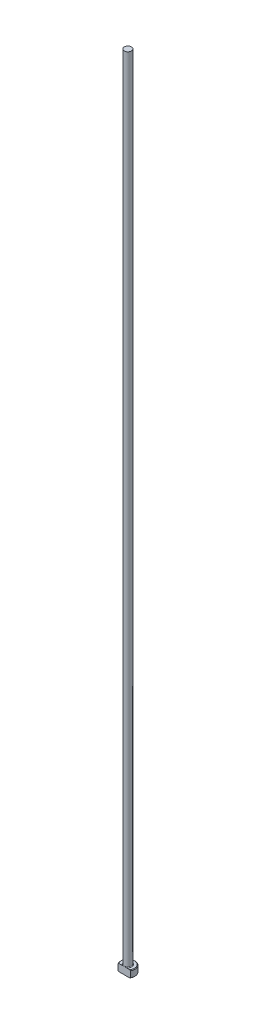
ISO-10303-21;
HEADER;
FILE_DESCRIPTION(('STEP AP214'),'2;1');
FILE_NAME('part.step','',(''),(''),'','','');
FILE_SCHEMA(('AUTOMOTIVE_DESIGN { 1 0 10303 214 1 1 1 1 }'));
ENDSEC;
DATA;
#1=APPLICATION_CONTEXT('core data for automotive mechanical design processes');
#2=APPLICATION_PROTOCOL_DEFINITION('international standard','automotive_design',2000,#1);
#3=PRODUCT_CONTEXT('',#1,'mechanical');
#4=PRODUCT('Part','Part','',(#3));
#5=PRODUCT_RELATED_PRODUCT_CATEGORY('part','',(#4));
#6=PRODUCT_DEFINITION_FORMATION('','',#4);
#7=PRODUCT_DEFINITION_CONTEXT('part definition',#1,'design');
#8=PRODUCT_DEFINITION('design','',#6,#7);
#9=PRODUCT_DEFINITION_SHAPE('','',#8);
#10=(LENGTH_UNIT() NAMED_UNIT(*) SI_UNIT(.MILLI.,.METRE.));
#11=(NAMED_UNIT(*) PLANE_ANGLE_UNIT() SI_UNIT($,.RADIAN.));
#12=(NAMED_UNIT(*) SI_UNIT($,.STERADIAN.) SOLID_ANGLE_UNIT());
#13=UNCERTAINTY_MEASURE_WITH_UNIT(LENGTH_MEASURE(1.E-05),#10,'distance_accuracy_value','');
#14=(GEOMETRIC_REPRESENTATION_CONTEXT(3) GLOBAL_UNCERTAINTY_ASSIGNED_CONTEXT((#13)) GLOBAL_UNIT_ASSIGNED_CONTEXT((#10,
#11,#12)) REPRESENTATION_CONTEXT('',''));
#15=CARTESIAN_POINT('',(0.,0.,0.));
#16=DIRECTION('',(0.,0.,1.));
#17=DIRECTION('',(1.,0.,0.));
#18=AXIS2_PLACEMENT_3D('',#15,#16,#17);
#19=CARTESIAN_POINT('',(0.,0.,0.));
#20=DIRECTION('',(0.,-1.,0.));
#21=DIRECTION('',(0.,0.,-1.));
#22=AXIS2_PLACEMENT_3D('',#19,#20,#21);
#23=PLANE('',#22);
#24=CARTESIAN_POINT('',(0.,0.,0.));
#25=DIRECTION('',(0.,-1.,0.));
#26=DIRECTION('',(0.,0.,-1.));
#27=AXIS2_PLACEMENT_3D('',#24,#25,#26);
#28=CIRCLE('',#27,2.92099999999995);
#29=CARTESIAN_POINT('',(-2.45195529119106,0.,1.58749999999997));
#30=VERTEX_POINT('',#29);
#31=CARTESIAN_POINT('',(2.45195529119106,0.,1.58749999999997));
#32=VERTEX_POINT('',#31);
#33=EDGE_CURVE('E98',#30,#32,#28,.T.);
#34=ORIENTED_EDGE('',*,*,#33,.T.);
#35=DIRECTION('',(-1.,0.,0.));
#36=VECTOR('',#35,1.);
#37=CARTESIAN_POINT('',(-2.74963065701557,0.,1.58749999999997));
#38=LINE('',#37,#36);
#39=EDGE_CURVE('E83',#32,#30,#38,.T.);
#40=ORIENTED_EDGE('',*,*,#39,.T.);
#41=EDGE_LOOP('',(#34,#40));
#42=FACE_BOUND('',#41,.T.);
#43=ADVANCED_FACE('F32',(#42),#23,.T.);
#44=CARTESIAN_POINT('',(0.,259.958771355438,0.));
#45=DIRECTION('',(0.,1.,0.));
#46=DIRECTION('',(0.,0.,1.));
#47=AXIS2_PLACEMENT_3D('',#44,#45,#46);
#48=CYLINDRICAL_SURFACE('',#47,3.17499999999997);
#49=CARTESIAN_POINT('',(0.,2.92100000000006,0.));
#50=DIRECTION('',(0.,1.,0.));
#51=DIRECTION('',(0.,0.,1.));
#52=AXIS2_PLACEMENT_3D('',#49,#50,#51);
#53=CIRCLE('',#52,3.17499999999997);
#54=CARTESIAN_POINT('',(-2.74963065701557,2.92100000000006,1.58749999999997));
#55=VERTEX_POINT('',#54);
#56=CARTESIAN_POINT('',(2.74963065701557,2.92100000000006,1.58749999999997));
#57=VERTEX_POINT('',#56);
#58=EDGE_CURVE('E104',#55,#57,#53,.F.);
#59=ORIENTED_EDGE('',*,*,#58,.T.);
#60=DIRECTION('',(0.,-1.,0.));
#61=VECTOR('',#60,1.);
#62=CARTESIAN_POINT('',(2.74963065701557,355.6,1.58749999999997));
#63=LINE('',#62,#61);
#64=CARTESIAN_POINT('',(2.74963065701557,0.254000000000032,1.58749999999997));
#65=VERTEX_POINT('',#64);
#66=EDGE_CURVE('E183',#57,#65,#63,.T.);
#67=ORIENTED_EDGE('',*,*,#66,.T.);
#68=CARTESIAN_POINT('',(0.,0.254000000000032,0.));
#69=DIRECTION('',(0.,-1.,0.));
#70=DIRECTION('',(0.,0.,-1.));
#71=AXIS2_PLACEMENT_3D('',#68,#69,#70);
#72=CIRCLE('',#71,3.17499999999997);
#73=CARTESIAN_POINT('',(-2.74963065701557,0.254000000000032,1.58749999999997));
#74=VERTEX_POINT('',#73);
#75=EDGE_CURVE('E100',#65,#74,#72,.F.);
#76=ORIENTED_EDGE('',*,*,#75,.T.);
#77=DIRECTION('',(0.,-1.,0.));
#78=VECTOR('',#77,1.);
#79=CARTESIAN_POINT('',(-2.74963065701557,355.6,1.58749999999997));
#80=LINE('',#79,#78);
#81=EDGE_CURVE('E93',#55,#74,#80,.T.);
#82=ORIENTED_EDGE('',*,*,#81,.F.);
#83=EDGE_LOOP('',(#59,#67,#76,#82));
#84=FACE_BOUND('',#83,.T.);
#85=ADVANCED_FACE('F158',(#84),#48,.T.);
#86=CARTESIAN_POINT('',(-3.17499999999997,3.175,0.));
#87=DIRECTION('',(0.,1.,0.));
#88=DIRECTION('',(0.,0.,1.));
#89=AXIS2_PLACEMENT_3D('',#86,#87,#88);
#90=PLANE('',#89);
#91=CARTESIAN_POINT('',(0.,3.175,0.));
#92=DIRECTION('',(0.,1.,0.));
#93=DIRECTION('',(0.,0.,1.));
#94=AXIS2_PLACEMENT_3D('',#91,#92,#93);
#95=CIRCLE('',#94,2.92100000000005);
#96=CARTESIAN_POINT('',(2.45195529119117,3.175,1.58749999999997));
#97=VERTEX_POINT('',#96);
#98=CARTESIAN_POINT('',(-2.45195529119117,3.175,1.58749999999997));
#99=VERTEX_POINT('',#98);
#100=EDGE_CURVE('E178',#97,#99,#95,.T.);
#101=ORIENTED_EDGE('',*,*,#100,.T.);
#102=DIRECTION('',(1.,0.,0.));
#103=VECTOR('',#102,1.);
#104=CARTESIAN_POINT('',(-3.17499999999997,3.175,1.58749999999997));
#105=LINE('',#104,#103);
#106=CARTESIAN_POINT('',(-0.933255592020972,3.17500000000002,1.58749999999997));
#107=VERTEX_POINT('',#106);
#108=EDGE_CURVE('E57',#99,#107,#105,.T.);
#109=ORIENTED_EDGE('',*,*,#108,.T.);
#110=CARTESIAN_POINT('',(0.,3.175,0.));
#111=DIRECTION('',(0.,1.,0.));
#112=DIRECTION('',(0.,0.,1.));
#113=AXIS2_PLACEMENT_3D('',#110,#111,#112);
#114=CIRCLE('',#113,1.84149999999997);
#115=CARTESIAN_POINT('',(0.933255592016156,3.17500000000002,1.58749999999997));
#116=VERTEX_POINT('',#115);
#117=EDGE_CURVE('E107',#107,#116,#114,.F.);
#118=ORIENTED_EDGE('',*,*,#117,.T.);
#119=EDGE_CURVE('E136',#116,#97,#105,.T.);
#120=ORIENTED_EDGE('',*,*,#119,.T.);
#121=EDGE_LOOP('',(#101,#109,#118,#120));
#122=FACE_BOUND('',#121,.T.);
#123=ADVANCED_FACE('F147',(#122),#90,.T.);
#124=CARTESIAN_POINT('',(0.,3.17499999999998,0.));
#125=DIRECTION('',(0.,-1.,0.));
#126=DIRECTION('',(0.,0.,-1.));
#127=AXIS2_PLACEMENT_3D('',#124,#125,#126);
#128=CONICAL_SURFACE('',#127,2.92100000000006,0.785398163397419);
#129=ORIENTED_EDGE('',*,*,#58,.F.);
#130=CARTESIAN_POINT('',(-6.0529050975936,-0.161620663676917,1.58749999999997));
#131=CARTESIAN_POINT('',(-5.91567682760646,-0.0288893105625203,1.58749999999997));
#132=CARTESIAN_POINT('',(-5.77831035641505,0.1036996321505,1.58749999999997));
#133=CARTESIAN_POINT('',(-5.50321874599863,0.368508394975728,1.58749999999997));
#134=CARTESIAN_POINT('',(-5.36549360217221,0.500728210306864,1.58749999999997));
#135=CARTESIAN_POINT('',(-5.08953516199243,0.764778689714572,1.58749999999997));
#136=CARTESIAN_POINT('',(-4.95130164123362,0.89660911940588,1.58749999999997));
#137=CARTESIAN_POINT('',(-4.67428233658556,1.15968706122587,1.58749999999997));
#138=CARTESIAN_POINT('',(-4.5354965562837,1.2909345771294,1.58749999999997));
#139=CARTESIAN_POINT('',(-4.25997724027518,1.55007705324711,1.58749999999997));
#140=CARTESIAN_POINT('',(-4.12325766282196,1.67798684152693,1.58749999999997));
#141=CARTESIAN_POINT('',(-3.84892898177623,1.93284861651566,1.58749999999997));
#142=CARTESIAN_POINT('',(-3.71131988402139,2.05980060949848,1.58749999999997));
#143=CARTESIAN_POINT('',(-3.43493978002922,2.31237508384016,1.58749999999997));
#144=CARTESIAN_POINT('',(-3.29616903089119,2.43799784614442,1.58749999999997));
#145=CARTESIAN_POINT('',(-3.0169955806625,2.6874136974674,1.58749999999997));
#146=CARTESIAN_POINT('',(-2.87659294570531,2.81120686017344,1.58749999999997));
#147=CARTESIAN_POINT('',(-2.64816703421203,3.00875865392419,1.58749999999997));
#148=CARTESIAN_POINT('',(-2.56087478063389,3.08336151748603,1.58749999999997));
#149=CARTESIAN_POINT('',(-2.38515423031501,3.2312387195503,1.58749999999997));
#150=CARTESIAN_POINT('',(-2.2967258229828,3.30451292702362,1.58749999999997));
#151=CARTESIAN_POINT('',(-2.11747400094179,3.45004422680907,1.58749999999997));
#152=CARTESIAN_POINT('',(-2.02663514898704,3.522282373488,1.58749999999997));
#153=CARTESIAN_POINT('',(-1.84302524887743,3.66423097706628,1.58749999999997));
#154=CARTESIAN_POINT('',(-1.7502546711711,3.73394203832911,1.58749999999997));
#155=CARTESIAN_POINT('',(-1.56067475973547,3.87080633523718,1.58749999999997));
#156=CARTESIAN_POINT('',(-1.46382547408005,3.93790459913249,1.58749999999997));
#157=CARTESIAN_POINT('',(-1.26632594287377,4.06669147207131,1.58749999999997));
#158=CARTESIAN_POINT('',(-1.1656707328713,4.12837264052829,1.58749999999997));
#159=CARTESIAN_POINT('',(-1.01165766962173,4.21402252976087,1.58749999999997));
#160=CARTESIAN_POINT('',(-0.960142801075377,4.24127929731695,1.58749999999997));
#161=CARTESIAN_POINT('',(-0.855780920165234,4.29309798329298,1.58749999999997));
#162=CARTESIAN_POINT('',(-0.802933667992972,4.31765941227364,1.58749999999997));
#163=CARTESIAN_POINT('',(-0.64246114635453,4.38614656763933,1.58749999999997));
#164=CARTESIAN_POINT('',(-0.53251850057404,4.42510149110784,1.58749999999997));
#165=CARTESIAN_POINT('',(-0.367680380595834,4.46726244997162,1.58749999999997));
#166=CARTESIAN_POINT('',(-0.314802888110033,4.47844427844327,1.58749999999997));
#167=CARTESIAN_POINT('',(-0.208209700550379,4.49576654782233,1.58749999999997));
#168=CARTESIAN_POINT('',(-0.154494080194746,4.50190743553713,1.58749999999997));
#169=CARTESIAN_POINT('',(-0.0468792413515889,4.50871296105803,1.58749999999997));
#170=CARTESIAN_POINT('',(0.0070188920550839,4.5093945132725,1.58749999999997));
#171=CARTESIAN_POINT('',(0.114606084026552,4.50527679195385,1.58749999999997));
#172=CARTESIAN_POINT('',(0.168295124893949,4.50047706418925,1.58749999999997));
#173=CARTESIAN_POINT('',(0.274485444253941,4.48579689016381,1.58749999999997));
#174=CARTESIAN_POINT('',(0.326992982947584,4.47596081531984,1.58749999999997));
#175=CARTESIAN_POINT('',(0.430974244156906,4.45181809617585,1.58749999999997));
#176=CARTESIAN_POINT('',(0.482447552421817,4.4375096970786,1.58749999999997));
#177=CARTESIAN_POINT('',(0.58446088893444,4.40502489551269,1.58749999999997));
#178=CARTESIAN_POINT('',(0.634994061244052,4.38682724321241,1.58749999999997));
#179=CARTESIAN_POINT('',(0.734789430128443,4.34729308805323,1.58749999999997));
#180=CARTESIAN_POINT('',(0.784051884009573,4.32595722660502,1.58749999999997));
#181=CARTESIAN_POINT('',(0.930549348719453,4.25791922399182,1.58749999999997));
#182=CARTESIAN_POINT('',(1.02598802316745,4.20736047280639,1.58749999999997));
#183=CARTESIAN_POINT('',(1.21304313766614,4.09955451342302,1.58749999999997));
#184=CARTESIAN_POINT('',(1.30465471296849,4.042299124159,1.58749999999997));
#185=CARTESIAN_POINT('',(1.48526211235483,3.92308746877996,1.58749999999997));
#186=CARTESIAN_POINT('',(1.57424615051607,3.86111349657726,1.58749999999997));
#187=CARTESIAN_POINT('',(1.74990003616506,3.73408621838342,1.58749999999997));
#188=CARTESIAN_POINT('',(1.8365709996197,3.66903444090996,1.58749999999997));
#189=CARTESIAN_POINT('',(2.00931764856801,3.53583371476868,1.58749999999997));
#190=CARTESIAN_POINT('',(2.09537048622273,3.4676552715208,1.58749999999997));
#191=CARTESIAN_POINT('',(2.26611736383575,3.32960643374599,1.58749999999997));
#192=CARTESIAN_POINT('',(2.35081125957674,3.25973586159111,1.58749999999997));
#193=CARTESIAN_POINT('',(2.60290121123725,3.04858139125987,1.58749999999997));
#194=CARTESIAN_POINT('',(2.76872537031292,2.90542388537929,1.58749999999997));
#195=CARTESIAN_POINT('',(3.06970913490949,2.64069522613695,1.58749999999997));
#196=CARTESIAN_POINT('',(3.2052866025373,2.51959458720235,1.58749999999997));
#197=CARTESIAN_POINT('',(3.47510321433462,2.27590400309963,1.58749999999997));
#198=CARTESIAN_POINT('',(3.60934232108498,2.15331401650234,1.58749999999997));
#199=CARTESIAN_POINT('',(3.87695374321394,1.90694239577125,1.58749999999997));
#200=CARTESIAN_POINT('',(4.01032512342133,1.78315974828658,1.58749999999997));
#201=CARTESIAN_POINT('',(4.27630880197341,1.53478104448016,1.58749999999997));
#202=CARTESIAN_POINT('',(4.40892109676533,1.41018498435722,1.58749999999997));
#203=CARTESIAN_POINT('',(4.79499418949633,1.04574684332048,1.58749999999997));
#204=CARTESIAN_POINT('',(5.04767313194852,0.805076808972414,1.58749999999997));
#205=CARTESIAN_POINT('',(5.42550911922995,0.443121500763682,1.58749999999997));
#206=CARTESIAN_POINT('',(5.55118772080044,0.322378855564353,1.58749999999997));
#207=CARTESIAN_POINT('',(5.8022520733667,0.0805914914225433,1.58749999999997));
#208=CARTESIAN_POINT('',(5.92763782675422,-0.0404532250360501,1.58749999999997));
#209=CARTESIAN_POINT('',(6.0529050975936,-0.161620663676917,1.58749999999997));
#210=B_SPLINE_CURVE_WITH_KNOTS('',3,(#130,#131,#132,#133,#134,#135,#136,#137,#138,#139,#140,
#141,#142,#143,#144,#145,#146,#147,#148,#149,#150,#151,#152,#153,#154,#155,#156,#157,#158,#159,
#160,#161,#162,#163,#164,#165,#166,#167,#168,#169,#170,#171,#172,#173,#174,#175,#176,#177,#178,
#179,#180,#181,#182,#183,#184,#185,#186,#187,#188,#189,#190,#191,#192,#193,#194,#195,#196,#197,
#198,#199,#200,#201,#202,#203,#204,#205,#206,#207,#208,#209),.UNSPECIFIED.,.F.,.F.,(4,2,2,2,2,2,
2,2,2,2,2,2,2,2,2,2,2,2,2,2,2,2,2,2,2,2,2,2,2,2,2,2,2,2,2,2,2,2,2,4),(0.,0.572750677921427,
1.14550874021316,1.71856057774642,2.29160869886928,2.85328006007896,3.41494773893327,
3.97649423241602,4.5380180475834,4.88249307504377,5.22700189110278,5.57515326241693,
5.92322081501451,6.27657800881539,6.63041319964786,6.80518126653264,6.97998101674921,
7.32824262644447,7.49018491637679,7.65211285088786,7.81353889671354,7.97497832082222,
8.13501929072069,8.29512313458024,8.45612518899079,8.61709438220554,8.94062993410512,
9.26456495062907,9.58978187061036,9.91483894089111,10.2441741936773,10.5735441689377,
11.2306812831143,11.776033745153,12.3214014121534,12.8672825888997,13.4131663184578,
14.4600164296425,14.9828595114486,15.505698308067),.UNSPECIFIED.);
#211=EDGE_CURVE('E135',#55,#99,#210,.T.);
#212=ORIENTED_EDGE('',*,*,#211,.T.);
#213=ORIENTED_EDGE('',*,*,#100,.F.);
#214=EDGE_CURVE('E127',#97,#57,#210,.T.);
#215=ORIENTED_EDGE('',*,*,#214,.T.);
#216=EDGE_LOOP('',(#129,#212,#213,#215));
#217=FACE_BOUND('',#216,.T.);
#218=ADVANCED_FACE('F143',(#217),#128,.T.);
#219=CARTESIAN_POINT('',(0.,0.254000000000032,0.));
#220=DIRECTION('',(0.,1.,0.));
#221=DIRECTION('',(0.,0.,1.));
#222=AXIS2_PLACEMENT_3D('',#219,#220,#221);
#223=CONICAL_SURFACE('',#222,3.17499999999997,0.785398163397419);
#224=ORIENTED_EDGE('',*,*,#75,.F.);
#225=CARTESIAN_POINT('',(6.0529050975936,3.33662066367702,1.58749999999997));
#226=CARTESIAN_POINT('',(5.91567682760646,3.20388931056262,1.58749999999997));
#227=CARTESIAN_POINT('',(5.77831035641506,3.0713003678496,1.58749999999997));
#228=CARTESIAN_POINT('',(5.50321874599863,2.80649160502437,1.58749999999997));
#229=CARTESIAN_POINT('',(5.36549360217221,2.67427178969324,1.58749999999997));
#230=CARTESIAN_POINT('',(5.08953516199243,2.41022131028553,1.58749999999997));
#231=CARTESIAN_POINT('',(4.95130164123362,2.27839088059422,1.58749999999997));
#232=CARTESIAN_POINT('',(4.67428233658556,2.01531293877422,1.58749999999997));
#233=CARTESIAN_POINT('',(4.5354965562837,1.88406542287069,1.58749999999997));
#234=CARTESIAN_POINT('',(4.25997724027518,1.62492294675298,1.58749999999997));
#235=CARTESIAN_POINT('',(4.12325766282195,1.49701315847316,1.58749999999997));
#236=CARTESIAN_POINT('',(3.84892898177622,1.24215138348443,1.58749999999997));
#237=CARTESIAN_POINT('',(3.71131988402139,1.11519939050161,1.58749999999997));
#238=CARTESIAN_POINT('',(3.43493978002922,0.862624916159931,1.58749999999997));
#239=CARTESIAN_POINT('',(3.29616903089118,0.737002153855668,1.58749999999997));
#240=CARTESIAN_POINT('',(3.01699558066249,0.487586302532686,1.58749999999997));
#241=CARTESIAN_POINT('',(2.8765929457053,0.363793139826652,1.58749999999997));
#242=CARTESIAN_POINT('',(2.64816703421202,0.166241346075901,1.58749999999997));
#243=CARTESIAN_POINT('',(2.56087478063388,0.0916384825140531,1.58749999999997));
#244=CARTESIAN_POINT('',(2.385154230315,-0.056238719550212,1.58749999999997));
#245=CARTESIAN_POINT('',(2.29672582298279,-0.129512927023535,1.58749999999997));
#246=CARTESIAN_POINT('',(2.11747400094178,-0.275044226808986,1.58749999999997));
#247=CARTESIAN_POINT('',(2.02663514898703,-0.347282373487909,1.58749999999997));
#248=CARTESIAN_POINT('',(1.84302524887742,-0.489230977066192,1.58749999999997));
#249=CARTESIAN_POINT('',(1.75025467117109,-0.558942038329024,1.58749999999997));
#250=CARTESIAN_POINT('',(1.56067475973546,-0.695806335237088,1.58749999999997));
#251=CARTESIAN_POINT('',(1.46382547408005,-0.7629045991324,1.58749999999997));
#252=CARTESIAN_POINT('',(1.26632594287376,-0.891691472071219,1.58749999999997));
#253=CARTESIAN_POINT('',(1.16567073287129,-0.953372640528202,1.58749999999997));
#254=CARTESIAN_POINT('',(1.01165766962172,-1.03902252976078,1.58749999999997));
#255=CARTESIAN_POINT('',(0.96014280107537,-1.06627929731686,1.58749999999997));
#256=CARTESIAN_POINT('',(0.855780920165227,-1.11809798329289,1.58749999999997));
#257=CARTESIAN_POINT('',(0.802933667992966,-1.14265941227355,1.58749999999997));
#258=CARTESIAN_POINT('',(0.642461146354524,-1.21114656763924,1.58749999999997));
#259=CARTESIAN_POINT('',(0.532518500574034,-1.25010149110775,1.58749999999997));
#260=CARTESIAN_POINT('',(0.367680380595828,-1.29226244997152,1.58749999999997));
#261=CARTESIAN_POINT('',(0.314802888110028,-1.30344427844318,1.58749999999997));
#262=CARTESIAN_POINT('',(0.208209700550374,-1.32076654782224,1.58749999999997));
#263=CARTESIAN_POINT('',(0.154494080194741,-1.32690743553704,1.58749999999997));
#264=CARTESIAN_POINT('',(0.046879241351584,-1.33371296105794,1.58749999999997));
#265=CARTESIAN_POINT('',(-0.00701889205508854,-1.3343945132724,1.58749999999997));
#266=CARTESIAN_POINT('',(-0.114606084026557,-1.33027679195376,1.58749999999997));
#267=CARTESIAN_POINT('',(-0.168295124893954,-1.32547706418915,1.58749999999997));
#268=CARTESIAN_POINT('',(-0.274485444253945,-1.31079689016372,1.58749999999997));
#269=CARTESIAN_POINT('',(-0.326992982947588,-1.30096081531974,1.58749999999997));
#270=CARTESIAN_POINT('',(-0.43097424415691,-1.27681809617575,1.58749999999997));
#271=CARTESIAN_POINT('',(-0.482447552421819,-1.2625096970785,1.58749999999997));
#272=CARTESIAN_POINT('',(-0.584460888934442,-1.2300248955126,1.58749999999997));
#273=CARTESIAN_POINT('',(-0.634994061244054,-1.21182724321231,1.58749999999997));
#274=CARTESIAN_POINT('',(-0.734789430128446,-1.17229308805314,1.58749999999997));
#275=CARTESIAN_POINT('',(-0.784051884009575,-1.15095722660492,1.58749999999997));
#276=CARTESIAN_POINT('',(-0.930549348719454,-1.08291922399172,1.58749999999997));
#277=CARTESIAN_POINT('',(-1.02598802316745,-1.03236047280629,1.58749999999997));
#278=CARTESIAN_POINT('',(-1.21304313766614,-0.924554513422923,1.58749999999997));
#279=CARTESIAN_POINT('',(-1.3046547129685,-0.867299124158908,1.58749999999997));
#280=CARTESIAN_POINT('',(-1.48526211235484,-0.748087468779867,1.58749999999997));
#281=CARTESIAN_POINT('',(-1.57424615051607,-0.686113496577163,1.58749999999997));
#282=CARTESIAN_POINT('',(-1.74990003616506,-0.559086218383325,1.58749999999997));
#283=CARTESIAN_POINT('',(-1.8365709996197,-0.494034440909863,1.58749999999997));
#284=CARTESIAN_POINT('',(-2.00931764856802,-0.360833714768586,1.58749999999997));
#285=CARTESIAN_POINT('',(-2.09537048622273,-0.292655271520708,1.58749999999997));
#286=CARTESIAN_POINT('',(-2.26611736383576,-0.154606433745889,1.58749999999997));
#287=CARTESIAN_POINT('',(-2.35081125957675,-0.0847358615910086,1.58749999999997));
#288=CARTESIAN_POINT('',(-2.60290121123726,0.126418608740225,1.58749999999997));
#289=CARTESIAN_POINT('',(-2.76872537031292,0.269576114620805,1.58749999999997));
#290=CARTESIAN_POINT('',(-3.06970913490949,0.53430477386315,1.58749999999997));
#291=CARTESIAN_POINT('',(-3.2052866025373,0.655405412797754,1.58749999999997));
#292=CARTESIAN_POINT('',(-3.47510321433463,0.899095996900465,1.58749999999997));
#293=CARTESIAN_POINT('',(-3.60934232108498,1.02168598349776,1.58749999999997));
#294=CARTESIAN_POINT('',(-3.87695374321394,1.26805760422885,1.58749999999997));
#295=CARTESIAN_POINT('',(-4.01032512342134,1.39184025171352,1.58749999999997));
#296=CARTESIAN_POINT('',(-4.27630880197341,1.64021895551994,1.58749999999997));
#297=CARTESIAN_POINT('',(-4.40892109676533,1.76481501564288,1.58749999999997));
#298=CARTESIAN_POINT('',(-4.79499418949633,2.12925315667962,1.58749999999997));
#299=CARTESIAN_POINT('',(-5.04767313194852,2.36992319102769,1.58749999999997));
#300=CARTESIAN_POINT('',(-5.42550911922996,2.73187849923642,1.58749999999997));
#301=CARTESIAN_POINT('',(-5.55118772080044,2.85262114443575,1.58749999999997));
#302=CARTESIAN_POINT('',(-5.80225207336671,3.09440850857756,1.58749999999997));
#303=CARTESIAN_POINT('',(-5.92763782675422,3.21545322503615,1.58749999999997));
#304=CARTESIAN_POINT('',(-6.0529050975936,3.33662066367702,1.58749999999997));
#305=B_SPLINE_CURVE_WITH_KNOTS('',3,(#225,#226,#227,#228,#229,#230,#231,#232,#233,#234,#235,
#236,#237,#238,#239,#240,#241,#242,#243,#244,#245,#246,#247,#248,#249,#250,#251,#252,#253,#254,
#255,#256,#257,#258,#259,#260,#261,#262,#263,#264,#265,#266,#267,#268,#269,#270,#271,#272,#273,
#274,#275,#276,#277,#278,#279,#280,#281,#282,#283,#284,#285,#286,#287,#288,#289,#290,#291,#292,
#293,#294,#295,#296,#297,#298,#299,#300,#301,#302,#303,#304),.UNSPECIFIED.,.F.,.F.,(4,2,2,2,2,2,
2,2,2,2,2,2,2,2,2,2,2,2,2,2,2,2,2,2,2,2,2,2,2,2,2,2,2,2,2,2,2,2,2,4),(0.,0.57275067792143,
1.14550874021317,1.71856057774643,2.29160869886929,2.85328006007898,3.41494773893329,
3.97649423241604,4.53801804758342,4.88249307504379,5.22700189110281,5.57515326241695,
5.92322081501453,6.27657800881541,6.63041319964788,6.80518126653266,6.97998101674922,
7.32824262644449,7.49018491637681,7.65211285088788,7.81353889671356,7.97497832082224,
8.13501929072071,8.29512313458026,8.45612518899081,8.61709438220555,8.94062993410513,
9.26456495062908,9.58978187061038,9.91483894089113,10.2441741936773,10.5735441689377,
11.2306812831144,11.776033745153,12.3214014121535,12.8672825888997,13.4131663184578,
14.4600164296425,14.9828595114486,15.505698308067),.UNSPECIFIED.);
#306=EDGE_CURVE('E86',#65,#32,#305,.T.);
#307=ORIENTED_EDGE('',*,*,#306,.T.);
#308=ORIENTED_EDGE('',*,*,#33,.F.);
#309=EDGE_CURVE('E89',#30,#74,#305,.T.);
#310=ORIENTED_EDGE('',*,*,#309,.T.);
#311=EDGE_LOOP('',(#224,#307,#308,#310));
#312=FACE_BOUND('',#311,.T.);
#313=ADVANCED_FACE('F97',(#312),#223,.T.);
#314=CARTESIAN_POINT('',(0.,3.42900000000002,0.));
#315=DIRECTION('',(0.,1.,0.));
#316=DIRECTION('',(0.,0.,1.));
#317=AXIS2_PLACEMENT_3D('',#314,#315,#316);
#318=TOROIDAL_SURFACE('',#317,1.84149999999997,0.254);
#319=CARTESIAN_POINT('',(0.,3.42900000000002,1.58749999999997));
#320=CARTESIAN_POINT('',(1.92205032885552E-10,3.42900057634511,1.58749999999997));
#321=CARTESIAN_POINT('',(1.22611616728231E-07,3.42900115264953,1.58749999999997));
#322=CARTESIAN_POINT('',(5.09676370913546E-07,3.42900226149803,1.58749999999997));
#323=CARTESIAN_POINT('',(7.78176335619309E-07,3.42900279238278,1.58749999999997));
#324=CARTESIAN_POINT('',(1.42307273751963E-06,3.42900385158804,1.58749999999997));
#325=CARTESIAN_POINT('',(1.8071386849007E-06,3.42900437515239,1.58749999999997));
#326=CARTESIAN_POINT('',(2.63494847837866E-06,3.42900536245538,1.58749999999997));
#327=CARTESIAN_POINT('',(3.07814758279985E-06,3.42900582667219,1.58749999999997));
#328=CARTESIAN_POINT('',(4.66897360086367E-06,3.42900738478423,1.58749999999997));
#329=CARTESIAN_POINT('',(5.89404911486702E-06,3.42900840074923,1.58749999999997));
#330=CARTESIAN_POINT('',(8.42427515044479E-06,3.42901020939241,1.58749999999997));
#331=CARTESIAN_POINT('',(9.72480578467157E-06,3.42901100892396,1.58749999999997));
#332=CARTESIAN_POINT('',(1.48060602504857E-05,3.42901401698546,1.58749999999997));
#333=CARTESIAN_POINT('',(1.86838282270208E-05,3.42901606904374,1.58749999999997));
#334=CARTESIAN_POINT('',(2.63261118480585E-05,3.42901942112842,1.58749999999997));
#335=CARTESIAN_POINT('',(3.00687418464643E-05,3.42902077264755,1.58749999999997));
#336=CARTESIAN_POINT('',(4.60276300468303E-05,3.42902652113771,1.58749999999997));
#337=CARTESIAN_POINT('',(5.82470200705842E-05,3.4290308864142,1.58749999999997));
#338=CARTESIAN_POINT('',(8.11070099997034E-05,3.42903788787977,1.58749999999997));
#339=CARTESIAN_POINT('',(9.16953117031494E-05,3.42904068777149,1.58749999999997));
#340=CARTESIAN_POINT('',(0.000168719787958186,3.42906287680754,1.58749999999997));
#341=CARTESIAN_POINT('',(0.000232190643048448,3.42909118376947,1.58749999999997));
#342=CARTESIAN_POINT('',(0.000479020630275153,3.4291972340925,1.58749999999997));
#343=CARTESIAN_POINT('',(0.000664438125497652,3.42926834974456,1.58749999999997));
#344=CARTESIAN_POINT('',(0.00138448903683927,3.42954862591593,1.58749999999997));
#345=CARTESIAN_POINT('',(0.00191701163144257,3.42976473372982,1.58749999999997));
#346=CARTESIAN_POINT('',(0.00409774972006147,3.43064550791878,1.58749999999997));
#347=CARTESIAN_POINT('',(0.00574830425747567,3.43130231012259,1.58749999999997));
#348=CARTESIAN_POINT('',(0.0289985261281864,3.44055947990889,1.58749999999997));
#349=CARTESIAN_POINT('',(0.0505816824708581,3.44921674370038,1.58749999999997));
#350=CARTESIAN_POINT('',(0.0929947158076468,3.46610702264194,1.58749999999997));
#351=CARTESIAN_POINT('',(0.113823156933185,3.47434394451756,1.58749999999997));
#352=CARTESIAN_POINT('',(0.157956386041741,3.49164606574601,1.58749999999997));
#353=CARTESIAN_POINT('',(0.181267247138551,3.50069608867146,1.58749999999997));
#354=CARTESIAN_POINT('',(0.228222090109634,3.5186322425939,1.58749999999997));
#355=CARTESIAN_POINT('',(0.251867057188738,3.52751579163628,1.58749999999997));
#356=CARTESIAN_POINT('',(0.310512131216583,3.54905503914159,1.58749999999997));
#357=CARTESIAN_POINT('',(0.345588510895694,3.56150550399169,1.58749999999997));
#358=CARTESIAN_POINT('',(0.415278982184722,3.58503024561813,1.58749999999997));
#359=CARTESIAN_POINT('',(0.44988436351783,3.59613012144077,1.58749999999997));
#360=CARTESIAN_POINT('',(0.524471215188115,3.61841679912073,1.58749999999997));
#361=CARTESIAN_POINT('',(0.564517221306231,3.62939137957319,1.58749999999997));
#362=CARTESIAN_POINT('',(0.645529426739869,3.64897465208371,1.58749999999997));
#363=CARTESIAN_POINT('',(0.686500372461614,3.6575641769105,1.58749999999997));
#364=CARTESIAN_POINT('',(0.771546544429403,3.67188287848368,1.58749999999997));
#365=CARTESIAN_POINT('',(0.815658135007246,3.67740449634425,1.58749999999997));
#366=CARTESIAN_POINT('',(0.904117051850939,3.68344603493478,1.58749999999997));
#367=CARTESIAN_POINT('',(0.948462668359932,3.68398638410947,1.58749999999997));
#368=CARTESIAN_POINT('',(1.02531896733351,3.67901051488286,1.58749999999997));
#369=CARTESIAN_POINT('',(1.05792141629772,3.67502604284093,1.58749999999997));
#370=CARTESIAN_POINT('',(1.12184393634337,3.66230832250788,1.58749999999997));
#371=CARTESIAN_POINT('',(1.15317534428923,3.65363950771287,1.58749999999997));
#372=CARTESIAN_POINT('',(1.19946468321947,3.63563847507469,1.58749999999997));
#373=CARTESIAN_POINT('',(1.21526783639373,3.62848492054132,1.58749999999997));
#374=CARTESIAN_POINT('',(1.24583726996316,3.61212937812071,1.58749999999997));
#375=CARTESIAN_POINT('',(1.26060215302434,3.60292469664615,1.58749999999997));
#376=CARTESIAN_POINT('',(1.2857581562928,3.5842151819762,1.58749999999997));
#377=CARTESIAN_POINT('',(1.2964438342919,3.57510998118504,1.58749999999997));
#378=CARTESIAN_POINT('',(1.31623154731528,3.55531539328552,1.58749999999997));
#379=CARTESIAN_POINT('',(1.32533681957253,3.5446293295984,1.58749999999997));
#380=CARTESIAN_POINT('',(1.33941140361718,3.52450022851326,1.58749999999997));
#381=CARTESIAN_POINT('',(1.34484814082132,3.51538553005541,1.58749999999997));
#382=CARTESIAN_POINT('',(1.35416329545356,3.49638544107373,1.58749999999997));
#383=CARTESIAN_POINT('',(1.35804267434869,3.48650053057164,1.58749999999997));
#384=CARTESIAN_POINT('',(1.36398436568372,3.46611321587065,1.58749999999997));
#385=CARTESIAN_POINT('',(1.3660335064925,3.45560690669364,1.58749999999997));
#386=CARTESIAN_POINT('',(1.3680840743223,3.43439627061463,1.58749999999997));
#387=CARTESIAN_POINT('',(1.36808648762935,3.42369204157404,1.58749999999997));
#388=CARTESIAN_POINT('',(1.36616208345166,3.40366716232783,1.58749999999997));
#389=CARTESIAN_POINT('',(1.36444960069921,3.39432493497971,1.58749999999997));
#390=CARTESIAN_POINT('',(1.35953338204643,3.37604480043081,1.58749999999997));
#391=CARTESIAN_POINT('',(1.3563294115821,3.36710695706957,1.58749999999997));
#392=CARTESIAN_POINT('',(1.34848006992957,3.34949697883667,1.58749999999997));
#393=CARTESIAN_POINT('',(1.3437857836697,3.34084688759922,1.58749999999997));
#394=CARTESIAN_POINT('',(1.3332444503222,3.32428742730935,1.58749999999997));
#395=CARTESIAN_POINT('',(1.32739692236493,3.31637836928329,1.58749999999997));
#396=CARTESIAN_POINT('',(1.31107304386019,3.2969287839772,1.58749999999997));
#397=CARTESIAN_POINT('',(1.29989286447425,3.28597778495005,1.58749999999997));
#398=CARTESIAN_POINT('',(1.275935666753,3.26597490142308,1.58749999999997));
#399=CARTESIAN_POINT('',(1.2631537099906,3.25692913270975,1.58749999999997));
#400=CARTESIAN_POINT('',(1.22930733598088,3.23613976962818,1.58749999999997));
#401=CARTESIAN_POINT('',(1.2075109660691,3.22559415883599,1.58749999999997));
#402=CARTESIAN_POINT('',(1.16266144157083,3.20795356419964,1.58749999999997));
#403=CARTESIAN_POINT('',(1.13960937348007,3.20085564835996,1.58749999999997));
#404=CARTESIAN_POINT('',(1.07603916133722,3.18534571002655,1.58749999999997));
#405=CARTESIAN_POINT('',(1.03486686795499,3.17965078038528,1.58749999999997));
#406=CARTESIAN_POINT('',(0.951558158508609,3.1741711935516,1.58749999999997));
#407=CARTESIAN_POINT('',(0.909417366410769,3.17449023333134,1.58749999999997));
#408=CARTESIAN_POINT('',(0.811383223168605,3.18054602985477,1.58749999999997));
#409=CARTESIAN_POINT('',(0.755610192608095,3.18806126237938,1.58749999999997));
#410=CARTESIAN_POINT('',(0.644937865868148,3.20866626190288,1.58749999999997));
#411=CARTESIAN_POINT('',(0.5900436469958,3.22178102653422,1.58749999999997));
#412=CARTESIAN_POINT('',(0.485757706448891,3.25059077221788,1.58749999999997));
#413=CARTESIAN_POINT('',(0.436281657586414,3.26598903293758,1.58749999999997));
#414=CARTESIAN_POINT('',(0.338551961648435,3.29877502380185,1.58749999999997));
#415=CARTESIAN_POINT('',(0.290291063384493,3.31614156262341,1.58749999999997));
#416=CARTESIAN_POINT('',(0.225557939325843,3.34039762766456,1.58749999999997));
#417=CARTESIAN_POINT('',(0.208874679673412,3.3467358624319,1.58749999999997));
#418=CARTESIAN_POINT('',(0.175123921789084,3.35969957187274,1.58749999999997));
#419=CARTESIAN_POINT('',(0.158057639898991,3.36632823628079,1.58749999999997));
#420=CARTESIAN_POINT('',(0.117638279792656,3.38214476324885,1.58749999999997));
#421=CARTESIAN_POINT('',(0.0943002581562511,3.39137029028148,1.58749999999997));
#422=CARTESIAN_POINT('',(0.0497824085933,3.40910304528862,1.58749999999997));
#423=CARTESIAN_POINT('',(0.0285986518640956,3.41759960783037,1.58749999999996));
#424=CARTESIAN_POINT('',(0.0057516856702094,3.42669635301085,1.58749999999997));
#425=CARTESIAN_POINT('',(0.00410451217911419,3.42735181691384,1.58749999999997));
#426=CARTESIAN_POINT('',(0.00192459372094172,3.42823223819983,1.58749999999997));
#427=CARTESIAN_POINT('',(0.00138952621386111,3.42844937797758,1.58749999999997));
#428=CARTESIAN_POINT('',(0.000666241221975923,3.42873091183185,1.58749999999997));
#429=CARTESIAN_POINT('',(0.000480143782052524,3.42880228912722,1.58749999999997));
#430=CARTESIAN_POINT('',(0.000232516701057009,3.42890868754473,1.58749999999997));
#431=CARTESIAN_POINT('',(0.000168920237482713,3.42893705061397,1.58749999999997));
#432=CARTESIAN_POINT('',(9.17527164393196E-05,3.42895927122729,1.58749999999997));
#433=CARTESIAN_POINT('',(8.11550295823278E-05,3.42896207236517,1.58749999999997));
#434=CARTESIAN_POINT('',(5.82743950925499E-05,3.42896908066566,1.58749999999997));
#435=CARTESIAN_POINT('',(4.60440003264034E-05,3.42897345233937,1.58749999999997));
#436=CARTESIAN_POINT('',(3.00727683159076E-05,3.42897920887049,1.58749999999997));
#437=CARTESIAN_POINT('',(2.63286808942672E-05,3.42898056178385,1.58749999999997));
#438=CARTESIAN_POINT('',(1.86836530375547E-05,3.42898391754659,1.58749999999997));
#439=CARTESIAN_POINT('',(1.48046518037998E-05,3.42898597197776,1.58749999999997));
#440=CARTESIAN_POINT('',(9.72223947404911E-06,3.42898898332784,1.58749999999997));
#441=CARTESIAN_POINT('',(8.42159652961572E-06,3.42898978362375,1.58749999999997));
#442=CARTESIAN_POINT('',(5.89129732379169E-06,3.4289915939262,1.58749999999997));
#443=CARTESIAN_POINT('',(4.66626869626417E-06,3.42899261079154,1.58749999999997));
#444=CARTESIAN_POINT('',(3.07568805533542E-06,3.42899417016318,1.58749999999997));
#445=CARTESIAN_POINT('',(2.63259567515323E-06,3.42899463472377,1.58749999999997));
#446=CARTESIAN_POINT('',(1.80506087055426E-06,3.42899562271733,1.58749999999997));
#447=CARTESIAN_POINT('',(1.42116389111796E-06,3.42899614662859,1.58749999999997));
#448=CARTESIAN_POINT('',(7.7667565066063E-07,3.42899720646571,1.58749999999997));
#449=CARTESIAN_POINT('',(5.08406493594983E-07,3.42899773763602,1.58749999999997));
#450=CARTESIAN_POINT('',(1.2190188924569E-07,3.4289988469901,1.58749999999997));
#451=CARTESIAN_POINT('',(-1.92251562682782E-10,3.4289994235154,1.58749999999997));
#452=CARTESIAN_POINT('',(0.,3.42900000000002,1.58749999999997));
#453=B_SPLINE_CURVE_WITH_KNOTS('',3,(#319,#320,#321,#322,#323,#324,#325,#326,#327,#328,#329,
#330,#331,#332,#333,#334,#335,#336,#337,#338,#339,#340,#341,#342,#343,#344,#345,#346,#347,#348,
#349,#350,#351,#352,#353,#354,#355,#356,#357,#358,#359,#360,#361,#362,#363,#364,#365,#366,#367,
#368,#369,#370,#371,#372,#373,#374,#375,#376,#377,#378,#379,#380,#381,#382,#383,#384,#385,#386,
#387,#388,#389,#390,#391,#392,#393,#394,#395,#396,#397,#398,#399,#400,#401,#402,#403,#404,#405,
#406,#407,#408,#409,#410,#411,#412,#413,#414,#415,#416,#417,#418,#419,#420,#421,#422,#423,#424,
#425,#426,#427,#428,#429,#430,#431,#432,#433,#434,#435,#436,#437,#438,#439,#440,#441,#442,#443,
#444,#445,#446,#447,#448,#449,#450,#451,#452),.UNSPECIFIED.,.T.,.F.,(4,2,2,2,2,2,2,2,2,2,2,2,2,
2,2,2,2,2,2,2,2,2,2,2,2,2,2,2,2,2,2,2,2,2,2,2,2,2,2,2,2,2,2,2,2,2,2,2,2,2,2,2,2,2,2,2,2,2,2,2,2,
2,2,2,2,2,4),(0.,1.72815455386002E-06,3.50429249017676E-06,5.44430995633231E-06,
7.3675523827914E-06,1.21190895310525E-05,1.66953773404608E-05,2.98160398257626E-05,
4.17409561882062E-05,8.0660475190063E-05,0.000113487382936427,0.000321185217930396,
0.00091759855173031,0.00264089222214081,0.00797105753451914,0.0777276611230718,
0.144923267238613,0.219939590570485,0.295714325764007,0.407362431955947,0.516367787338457,
0.640878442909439,0.766362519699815,0.899536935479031,1.03216495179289,1.13045740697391,
1.22743103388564,1.27935899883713,1.33135556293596,1.37333248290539,1.41522237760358,
1.44693946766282,1.47863694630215,1.51056074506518,1.54246916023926,1.57083210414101,
1.59919951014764,1.62861579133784,1.65804436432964,1.70472658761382,1.75155645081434,
1.82378709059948,1.89595619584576,2.01995471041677,2.14609321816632,2.31447224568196,
2.48361094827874,2.63898919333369,2.79283011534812,2.84637031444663,2.90129461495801,
2.97658236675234,3.04504771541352,3.05036697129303,3.0520984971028,3.0526970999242,
3.05290520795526,3.05293806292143,3.05297701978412,3.05298895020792,3.05300207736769,
3.05300665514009,3.0530114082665,3.05301333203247,3.0530152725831,3.05301704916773,
3.05301877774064),.UNSPECIFIED.);
#454=CARTESIAN_POINT('',(0.,3.42900000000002,1.58749999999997));
#455=VERTEX_POINT('',#454);
#456=EDGE_CURVE('E11',#116,#455,#453,.T.);
#457=ORIENTED_EDGE('',*,*,#456,.F.);
#458=ORIENTED_EDGE('',*,*,#117,.F.);
#459=CARTESIAN_POINT('',(0.,3.42900000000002,1.58749999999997));
#460=CARTESIAN_POINT('',(-1.92205418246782E-10,3.42899942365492,1.58749999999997));
#461=CARTESIAN_POINT('',(-1.22611617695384E-07,3.4289988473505,1.58749999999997));
#462=CARTESIAN_POINT('',(-5.09676372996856E-07,3.428997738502,1.58749999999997));
#463=CARTESIAN_POINT('',(-7.7817633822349E-07,3.42899720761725,1.58749999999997));
#464=CARTESIAN_POINT('',(-1.42307274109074E-06,3.428996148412,1.58749999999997));
#465=CARTESIAN_POINT('',(-1.80713868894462E-06,3.42899562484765,1.58749999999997));
#466=CARTESIAN_POINT('',(-2.63494848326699E-06,3.42899463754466,1.58749999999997));
#467=CARTESIAN_POINT('',(-3.07814758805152E-06,3.42899417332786,1.58749999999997));
#468=CARTESIAN_POINT('',(-4.66897360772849E-06,3.42899261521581,1.58749999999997));
#469=CARTESIAN_POINT('',(-5.89404912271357E-06,3.42899159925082,1.58749999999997));
#470=CARTESIAN_POINT('',(-8.4242751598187E-06,3.42898979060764,1.58749999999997));
#471=CARTESIAN_POINT('',(-9.72480579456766E-06,3.4289889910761,1.58749999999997));
#472=CARTESIAN_POINT('',(-1.4806060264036E-05,3.4289859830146,1.58749999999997));
#473=CARTESIAN_POINT('',(-1.86838282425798E-05,3.42898393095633,1.58749999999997));
#474=CARTESIAN_POINT('',(-2.63261118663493E-05,3.42898057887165,1.58749999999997));
#475=CARTESIAN_POINT('',(-3.00687418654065E-05,3.42897922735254,1.58749999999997));
#476=CARTESIAN_POINT('',(-4.60276300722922E-05,3.42897347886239,1.58749999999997));
#477=CARTESIAN_POINT('',(-5.82470201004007E-05,3.42896911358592,1.58749999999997));
#478=CARTESIAN_POINT('',(-8.11070100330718E-05,3.42896211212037,1.58749999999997));
#479=CARTESIAN_POINT('',(-9.16953117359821E-05,3.42895931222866,1.58749999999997));
#480=CARTESIAN_POINT('',(-0.000168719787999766,3.42893712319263,1.58749999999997));
#481=CARTESIAN_POINT('',(-0.000232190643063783,3.42890881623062,1.58749999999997));
#482=CARTESIAN_POINT('',(-0.000479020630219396,3.42880276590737,1.58749999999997));
#483=CARTESIAN_POINT('',(-0.000664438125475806,3.42873165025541,1.58749999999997));
#484=CARTESIAN_POINT('',(-0.00138448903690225,3.42845137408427,1.58749999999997));
#485=CARTESIAN_POINT('',(-0.00191701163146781,3.42823526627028,1.58749999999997));
#486=CARTESIAN_POINT('',(-0.00409774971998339,3.42735449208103,1.58749999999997));
#487=CARTESIAN_POINT('',(-0.00574830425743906,3.42669768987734,1.58749999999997));
#488=CARTESIAN_POINT('',(-0.0289985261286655,3.41744052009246,1.58749999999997));
#489=CARTESIAN_POINT('',(-0.0505816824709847,3.4087832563,1.58749999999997));
#490=CARTESIAN_POINT('',(-0.0929947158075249,3.39189297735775,1.58749999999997));
#491=CARTESIAN_POINT('',(-0.113823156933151,3.38365605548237,1.58749999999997));
#492=CARTESIAN_POINT('',(-0.157956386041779,3.36635393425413,1.58749999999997));
#493=CARTESIAN_POINT('',(-0.181267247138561,3.3573039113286,1.58749999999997));
#494=CARTESIAN_POINT('',(-0.228222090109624,3.3393677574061,1.58749999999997));
#495=CARTESIAN_POINT('',(-0.251867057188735,3.33048420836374,1.58749999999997));
#496=CARTESIAN_POINT('',(-0.310512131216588,3.30894496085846,1.58749999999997));
#497=CARTESIAN_POINT('',(-0.345588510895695,3.29649449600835,1.58749999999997));
#498=CARTESIAN_POINT('',(-0.415278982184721,3.27296975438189,1.58749999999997));
#499=CARTESIAN_POINT('',(-0.449884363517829,3.26186987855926,1.58749999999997));
#500=CARTESIAN_POINT('',(-0.524471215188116,3.2395832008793,1.58749999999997));
#501=CARTESIAN_POINT('',(-0.564517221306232,3.22860862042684,1.58749999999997));
#502=CARTESIAN_POINT('',(-0.645529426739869,3.20902534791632,1.58749999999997));
#503=CARTESIAN_POINT('',(-0.686500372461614,3.20043582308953,1.58749999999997));
#504=CARTESIAN_POINT('',(-0.771546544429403,3.18611712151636,1.58749999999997));
#505=CARTESIAN_POINT('',(-0.815658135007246,3.18059550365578,1.58749999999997));
#506=CARTESIAN_POINT('',(-0.904117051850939,3.17455396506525,1.58749999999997));
#507=CARTESIAN_POINT('',(-0.948462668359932,3.17401361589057,1.58749999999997));
#508=CARTESIAN_POINT('',(-1.02531896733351,3.17898948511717,1.58749999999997));
#509=CARTESIAN_POINT('',(-1.05792141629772,3.1829739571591,1.58749999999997));
#510=CARTESIAN_POINT('',(-1.12184393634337,3.19569167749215,1.58749999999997));
#511=CARTESIAN_POINT('',(-1.15317534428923,3.20436049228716,1.58749999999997));
#512=CARTESIAN_POINT('',(-1.19946468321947,3.22236152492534,1.58749999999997));
#513=CARTESIAN_POINT('',(-1.21526783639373,3.22951507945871,1.58749999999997));
#514=CARTESIAN_POINT('',(-1.24583726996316,3.24587062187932,1.58749999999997));
#515=CARTESIAN_POINT('',(-1.26060215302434,3.25507530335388,1.58749999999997));
#516=CARTESIAN_POINT('',(-1.2857581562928,3.27378481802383,1.58749999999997));
#517=CARTESIAN_POINT('',(-1.2964438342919,3.28289001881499,1.58749999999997));
#518=CARTESIAN_POINT('',(-1.31623154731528,3.30268460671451,1.58749999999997));
#519=CARTESIAN_POINT('',(-1.32533681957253,3.31337067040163,1.58749999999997));
#520=CARTESIAN_POINT('',(-1.33941140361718,3.33349977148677,1.58749999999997));
#521=CARTESIAN_POINT('',(-1.34484814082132,3.34261446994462,1.58749999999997));
#522=CARTESIAN_POINT('',(-1.35416329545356,3.3616145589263,1.58749999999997));
#523=CARTESIAN_POINT('',(-1.35804267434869,3.37149946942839,1.58749999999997));
#524=CARTESIAN_POINT('',(-1.36398436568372,3.39188678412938,1.58749999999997));
#525=CARTESIAN_POINT('',(-1.3660335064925,3.40239309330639,1.58749999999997));
#526=CARTESIAN_POINT('',(-1.3680840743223,3.4236037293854,1.58749999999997));
#527=CARTESIAN_POINT('',(-1.36808648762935,3.43430795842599,1.58749999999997));
#528=CARTESIAN_POINT('',(-1.36616208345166,3.4543328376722,1.58749999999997));
#529=CARTESIAN_POINT('',(-1.36444960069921,3.46367506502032,1.58749999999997));
#530=CARTESIAN_POINT('',(-1.35953338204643,3.48195519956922,1.58749999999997));
#531=CARTESIAN_POINT('',(-1.3563294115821,3.49089304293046,1.58749999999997));
#532=CARTESIAN_POINT('',(-1.34848006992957,3.50850302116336,1.58749999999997));
#533=CARTESIAN_POINT('',(-1.3437857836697,3.51715311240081,1.58749999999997));
#534=CARTESIAN_POINT('',(-1.3332444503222,3.53371257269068,1.58749999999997));
#535=CARTESIAN_POINT('',(-1.32739692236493,3.54162163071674,1.58749999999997));
#536=CARTESIAN_POINT('',(-1.31107304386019,3.56107121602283,1.58749999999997));
#537=CARTESIAN_POINT('',(-1.29989286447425,3.57202221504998,1.58749999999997));
#538=CARTESIAN_POINT('',(-1.275935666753,3.59202509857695,1.58749999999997));
#539=CARTESIAN_POINT('',(-1.2631537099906,3.60107086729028,1.58749999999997));
#540=CARTESIAN_POINT('',(-1.22930733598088,3.62186023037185,1.58749999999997));
#541=CARTESIAN_POINT('',(-1.2075109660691,3.63240584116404,1.58749999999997));
#542=CARTESIAN_POINT('',(-1.16266144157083,3.6500464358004,1.58749999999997));
#543=CARTESIAN_POINT('',(-1.13960937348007,3.65714435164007,1.58749999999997));
#544=CARTESIAN_POINT('',(-1.07603916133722,3.67265428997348,1.58749999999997));
#545=CARTESIAN_POINT('',(-1.03486686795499,3.67834921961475,1.58749999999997));
#546=CARTESIAN_POINT('',(-0.951558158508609,3.68382880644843,1.58749999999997));
#547=CARTESIAN_POINT('',(-0.909417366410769,3.68350976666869,1.58749999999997));
#548=CARTESIAN_POINT('',(-0.811383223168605,3.67745397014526,1.58749999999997));
#549=CARTESIAN_POINT('',(-0.755610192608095,3.66993873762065,1.58749999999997));
#550=CARTESIAN_POINT('',(-0.644937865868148,3.64933373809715,1.58749999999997));
#551=CARTESIAN_POINT('',(-0.5900436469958,3.63621897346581,1.58749999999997));
#552=CARTESIAN_POINT('',(-0.485757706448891,3.60740922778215,1.58749999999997));
#553=CARTESIAN_POINT('',(-0.436281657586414,3.59201096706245,1.58749999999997));
#554=CARTESIAN_POINT('',(-0.338551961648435,3.55922497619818,1.58749999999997));
#555=CARTESIAN_POINT('',(-0.290291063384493,3.54185843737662,1.58749999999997));
#556=CARTESIAN_POINT('',(-0.225557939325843,3.51760237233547,1.58749999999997));
#557=CARTESIAN_POINT('',(-0.208874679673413,3.51126413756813,1.58749999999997));
#558=CARTESIAN_POINT('',(-0.175123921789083,3.49830042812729,1.58749999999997));
#559=CARTESIAN_POINT('',(-0.15805763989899,3.49167176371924,1.58749999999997));
#560=CARTESIAN_POINT('',(-0.117638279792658,3.47585523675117,1.58749999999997));
#561=CARTESIAN_POINT('',(-0.0943002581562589,3.46662970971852,1.58749999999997));
#562=CARTESIAN_POINT('',(-0.0497824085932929,3.44889695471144,1.58749999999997));
#563=CARTESIAN_POINT('',(-0.02859865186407,3.44040039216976,1.58749999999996));
#564=CARTESIAN_POINT('',(-0.00575168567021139,3.43130364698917,1.58749999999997));
#565=CARTESIAN_POINT('',(-0.00410451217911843,3.43064818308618,1.58749999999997));
#566=CARTESIAN_POINT('',(-0.00192459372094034,3.42976776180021,1.58749999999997));
#567=CARTESIAN_POINT('',(-0.00138952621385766,3.42955062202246,1.58749999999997));
#568=CARTESIAN_POINT('',(-0.000666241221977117,3.42926908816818,1.58749999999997));
#569=CARTESIAN_POINT('',(-0.000480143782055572,3.4291977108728,1.58749999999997));
#570=CARTESIAN_POINT('',(-0.000232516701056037,3.4290913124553,1.58749999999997));
#571=CARTESIAN_POINT('',(-0.000168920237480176,3.42906294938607,1.58749999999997));
#572=CARTESIAN_POINT('',(-9.17527164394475E-05,3.42904072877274,1.58749999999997));
#573=CARTESIAN_POINT('',(-8.11550295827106E-05,3.42903792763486,1.58749999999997));
#574=CARTESIAN_POINT('',(-5.82743950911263E-05,3.42903091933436,1.58749999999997));
#575=CARTESIAN_POINT('',(-4.60440003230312E-05,3.42902654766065,1.58749999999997));
#576=CARTESIAN_POINT('',(-3.00727683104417E-05,3.42902079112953,1.58749999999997));
#577=CARTESIAN_POINT('',(-2.63286808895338E-05,3.42901943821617,1.58749999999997));
#578=CARTESIAN_POINT('',(-1.86836530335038E-05,3.42901608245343,1.58749999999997));
#579=CARTESIAN_POINT('',(-1.48046517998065E-05,3.42901402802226,1.58749999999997));
#580=CARTESIAN_POINT('',(-9.72223946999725E-06,3.42901101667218,1.58749999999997));
#581=CARTESIAN_POINT('',(-8.42159652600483E-06,3.42901021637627,1.58749999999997));
#582=CARTESIAN_POINT('',(-5.89129732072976E-06,3.42900840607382,1.58749999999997));
#583=CARTESIAN_POINT('',(-4.66626869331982E-06,3.42900738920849,1.58749999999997));
#584=CARTESIAN_POINT('',(-3.07568805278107E-06,3.42900582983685,1.58749999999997));
#585=CARTESIAN_POINT('',(-2.63259567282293E-06,3.42900536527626,1.58749999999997));
#586=CARTESIAN_POINT('',(-1.80506086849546E-06,3.42900437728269,1.58749999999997));
#587=CARTESIAN_POINT('',(-1.42116388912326E-06,3.42900385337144,1.58749999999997));
#588=CARTESIAN_POINT('',(-7.76675649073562E-07,3.42900279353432,1.58749999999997));
#589=CARTESIAN_POINT('',(-5.08406492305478E-07,3.429002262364,1.58749999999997));
#590=CARTESIAN_POINT('',(-1.21901888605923E-07,3.42900115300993,1.58749999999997));
#591=CARTESIAN_POINT('',(1.92251948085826E-10,3.42900057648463,1.58749999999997));
#592=CARTESIAN_POINT('',(0.,3.42900000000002,1.58749999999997));
#593=B_SPLINE_CURVE_WITH_KNOTS('',3,(#459,#460,#461,#462,#463,#464,#465,#466,#467,#468,#469,
#470,#471,#472,#473,#474,#475,#476,#477,#478,#479,#480,#481,#482,#483,#484,#485,#486,#487,#488,
#489,#490,#491,#492,#493,#494,#495,#496,#497,#498,#499,#500,#501,#502,#503,#504,#505,#506,#507,
#508,#509,#510,#511,#512,#513,#514,#515,#516,#517,#518,#519,#520,#521,#522,#523,#524,#525,#526,
#527,#528,#529,#530,#531,#532,#533,#534,#535,#536,#537,#538,#539,#540,#541,#542,#543,#544,#545,
#546,#547,#548,#549,#550,#551,#552,#553,#554,#555,#556,#557,#558,#559,#560,#561,#562,#563,#564,
#565,#566,#567,#568,#569,#570,#571,#572,#573,#574,#575,#576,#577,#578,#579,#580,#581,#582,#583,
#584,#585,#586,#587,#588,#589,#590,#591,#592),.UNSPECIFIED.,.T.,.F.,(4,2,2,2,2,2,2,2,2,2,2,2,2,
2,2,2,2,2,2,2,2,2,2,2,2,2,2,2,2,2,2,2,2,2,2,2,2,2,2,2,2,2,2,2,2,2,2,2,2,2,2,2,2,2,2,2,2,2,2,2,2,
2,2,2,2,2,4),(0.,1.72815455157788E-06,3.50429248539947E-06,5.4443099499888E-06,
7.3675523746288E-06,1.21190895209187E-05,1.66953773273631E-05,2.98160398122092E-05,
4.17409561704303E-05,8.06604751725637E-05,0.000113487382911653,0.000321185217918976,
0.000917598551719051,0.00264089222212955,0.00797105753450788,0.0777276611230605,
0.144923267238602,0.219939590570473,0.295714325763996,0.407362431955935,0.516367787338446,
0.640878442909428,0.766362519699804,0.89953693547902,1.03216495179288,1.1304574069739,
1.22743103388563,1.27935899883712,1.33135556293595,1.37333248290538,1.41522237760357,
1.44693946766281,1.47863694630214,1.51056074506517,1.54246916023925,1.570832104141,
1.59919951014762,1.62861579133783,1.65804436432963,1.70472658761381,1.75155645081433,
1.82378709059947,1.89595619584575,2.01995471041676,2.14609321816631,2.31447224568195,
2.48361094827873,2.63898919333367,2.79283011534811,2.84637031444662,2.901294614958,
2.97658236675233,3.04504771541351,3.05036697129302,3.05209849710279,3.05269709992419,
3.05290520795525,3.05293806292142,3.05297701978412,3.05298895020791,3.05300207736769,
3.05300665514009,3.05301140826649,3.05301333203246,3.05301527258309,3.05301704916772,
3.05301877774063),.UNSPECIFIED.);
#594=EDGE_CURVE('E46',#455,#107,#593,.T.);
#595=ORIENTED_EDGE('',*,*,#594,.F.);
#596=CARTESIAN_POINT('',(0.,3.42900000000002,0.));
#597=DIRECTION('',(0.,1.,0.));
#598=DIRECTION('',(0.,0.,1.));
#599=AXIS2_PLACEMENT_3D('',#596,#597,#598);
#600=CIRCLE('',#599,1.58749999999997);
#601=EDGE_CURVE('E103',#455,#455,#600,.T.);
#602=ORIENTED_EDGE('',*,*,#601,.F.);
#603=EDGE_LOOP('',(#457,#458,#595,#602));
#604=FACE_BOUND('',#603,.T.);
#605=ADVANCED_FACE('F34',(#604),#318,.F.);
#606=CARTESIAN_POINT('',(0.,259.958771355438,0.));
#607=DIRECTION('',(0.,1.,0.));
#608=DIRECTION('',(0.,0.,1.));
#609=AXIS2_PLACEMENT_3D('',#606,#607,#608);
#610=CYLINDRICAL_SURFACE('',#609,1.58749999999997);
#611=ORIENTED_EDGE('',*,*,#601,.T.);
#612=EDGE_LOOP('',(#611));
#613=FACE_BOUND('',#612,.T.);
#614=CARTESIAN_POINT('',(0.,355.6,0.));
#615=DIRECTION('',(0.,1.,0.));
#616=DIRECTION('',(0.,0.,1.));
#617=AXIS2_PLACEMENT_3D('',#614,#615,#616);
#618=CIRCLE('',#617,1.58749999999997);
#619=CARTESIAN_POINT('',(0.,355.6,1.58749999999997));
#620=VERTEX_POINT('',#619);
#621=EDGE_CURVE('E101',#620,#620,#618,.T.);
#622=ORIENTED_EDGE('',*,*,#621,.F.);
#623=EDGE_LOOP('',(#622));
#624=FACE_BOUND('',#623,.T.);
#625=ADVANCED_FACE('F155',(#613,#624),#610,.T.);
#626=CARTESIAN_POINT('',(-1.58749999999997,355.6,0.));
#627=DIRECTION('',(0.,1.,0.));
#628=DIRECTION('',(0.,0.,1.));
#629=AXIS2_PLACEMENT_3D('',#626,#627,#628);
#630=PLANE('',#629);
#631=ORIENTED_EDGE('',*,*,#621,.T.);
#632=EDGE_LOOP('',(#631));
#633=FACE_BOUND('',#632,.T.);
#634=ADVANCED_FACE('F121',(#633),#630,.T.);
#635=CARTESIAN_POINT('',(-2.74963065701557,355.6,1.58749999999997));
#636=DIRECTION('',(0.,0.,1.));
#637=DIRECTION('',(1.,0.,0.));
#638=AXIS2_PLACEMENT_3D('',#635,#636,#637);
#639=PLANE('',#638);
#640=ORIENTED_EDGE('',*,*,#66,.F.);
#641=ORIENTED_EDGE('',*,*,#214,.F.);
#642=ORIENTED_EDGE('',*,*,#119,.F.);
#643=ORIENTED_EDGE('',*,*,#456,.T.);
#644=ORIENTED_EDGE('',*,*,#594,.T.);
#645=ORIENTED_EDGE('',*,*,#108,.F.);
#646=ORIENTED_EDGE('',*,*,#211,.F.);
#647=ORIENTED_EDGE('',*,*,#81,.T.);
#648=ORIENTED_EDGE('',*,*,#309,.F.);
#649=ORIENTED_EDGE('',*,*,#39,.F.);
#650=ORIENTED_EDGE('',*,*,#306,.F.);
#651=EDGE_LOOP('',(#640,#641,#642,#643,#644,#645,#646,#647,#648,#649,#650));
#652=FACE_BOUND('',#651,.T.);
#653=ADVANCED_FACE('F85',(#652),#639,.T.);
#654=CLOSED_SHELL('',(#43,#85,#123,#218,#313,#605,#625,#634,#653));
#655=MANIFOLD_SOLID_BREP('B2',#654);
#656=ADVANCED_BREP_SHAPE_REPRESENTATION('',(#18,#655),#14);
#657=SHAPE_DEFINITION_REPRESENTATION(#9,#656);
ENDSEC;
END-ISO-10303-21;
